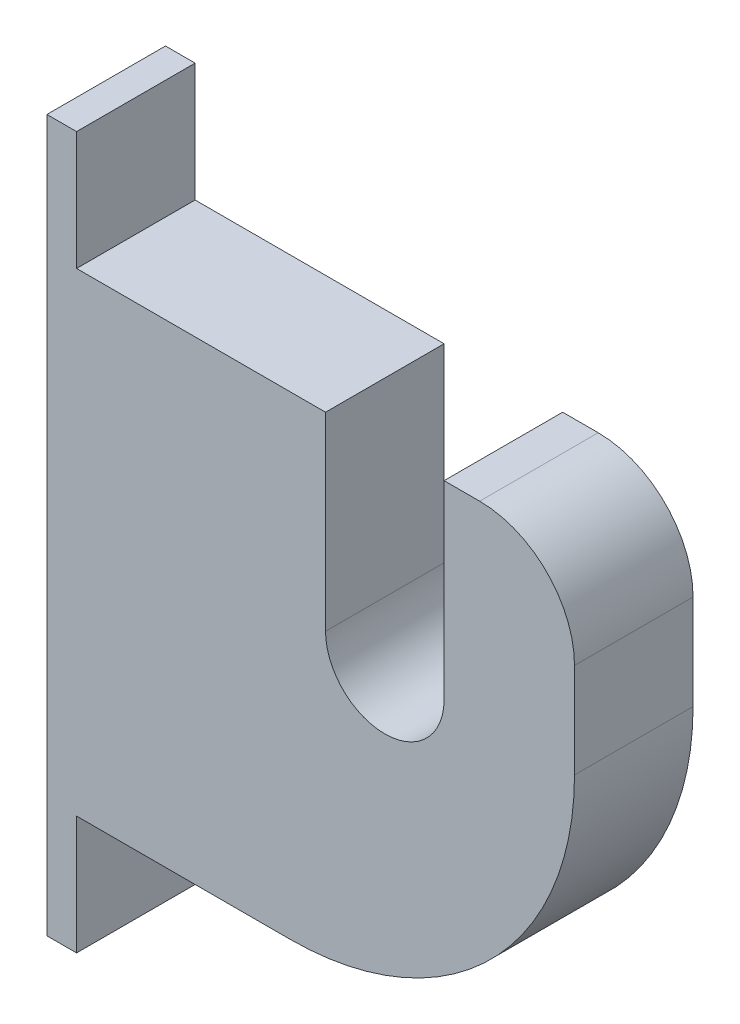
from build123d import *

# Parameters (mm, degrees)
BOSS_EXTRUDE1_DEPTH = 3.175


with BuildPart() as part:
    # Sketch1 → Boss-Extrude1 (new body)
    with BuildSketch(Plane.XY):
        with BuildLine():
            Line((95.25, 1.27), (95.25, 3.81))
            ThreePointArc((95.25, 3.81), (94.506051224, 5.606051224), (92.71, 6.35))
            Line((92.71, 6.35), (91.7575, 6.35))
            Line((91.7575, 6.35), (91.7575, 1.27))
            ThreePointArc((91.7575, 1.27), (90.17, -0.3175), (88.5825, 1.27))
            Line((88.5825, 1.27), (88.5825, 6.35))
            Line((88.5825, 6.35), (85.09, 6.35))
            Line((85.09, 6.35), (81.915, 6.35))
            Line((81.915, 6.35), (81.915, 9.525))
            Line((81.915, 9.525), (81.12125, 9.525))
            Line((81.12125, 9.525), (81.12125, 6.35))
            Line((81.12125, 6.35), (81.12125, -6.35))
            Line((81.12125, -6.35), (81.12125, -9.525))
            Line((81.12125, -9.525), (81.915, -9.525))
            Line((81.915, -9.525), (81.915, -6.35))
            Line((81.915, -6.35), (87.63, -6.35))
            ThreePointArc((87.63, -6.35), (93.018153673, -4.118153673), (95.25, 1.27))
        make_face()
    extrude(amount=BOSS_EXTRUDE1_DEPTH)


solid = part.part
